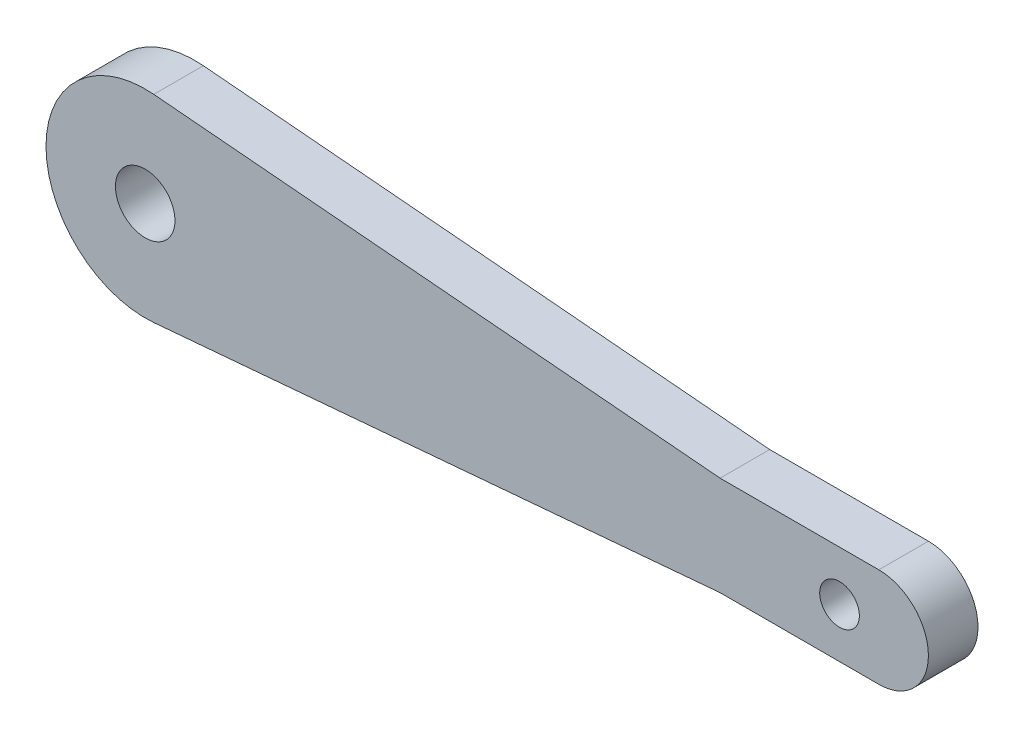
ISO-10303-21;
HEADER;
FILE_DESCRIPTION(('STEP AP214'),'2;1');
FILE_NAME('part.step','',(''),(''),'','','');
FILE_SCHEMA(('AUTOMOTIVE_DESIGN { 1 0 10303 214 1 1 1 1 }'));
ENDSEC;
DATA;
#1=APPLICATION_CONTEXT('core data for automotive mechanical design processes');
#2=APPLICATION_PROTOCOL_DEFINITION('international standard','automotive_design',2000,#1);
#3=PRODUCT_CONTEXT('',#1,'mechanical');
#4=PRODUCT('Part','Part','',(#3));
#5=PRODUCT_RELATED_PRODUCT_CATEGORY('part','',(#4));
#6=PRODUCT_DEFINITION_FORMATION('','',#4);
#7=PRODUCT_DEFINITION_CONTEXT('part definition',#1,'design');
#8=PRODUCT_DEFINITION('design','',#6,#7);
#9=PRODUCT_DEFINITION_SHAPE('','',#8);
#10=(LENGTH_UNIT() NAMED_UNIT(*) SI_UNIT(.MILLI.,.METRE.));
#11=(NAMED_UNIT(*) PLANE_ANGLE_UNIT() SI_UNIT($,.RADIAN.));
#12=(NAMED_UNIT(*) SI_UNIT($,.STERADIAN.) SOLID_ANGLE_UNIT());
#13=UNCERTAINTY_MEASURE_WITH_UNIT(LENGTH_MEASURE(1.E-05),#10,'distance_accuracy_value','');
#14=(GEOMETRIC_REPRESENTATION_CONTEXT(3) GLOBAL_UNCERTAINTY_ASSIGNED_CONTEXT((#13)) GLOBAL_UNIT_ASSIGNED_CONTEXT((#10,
#11,#12)) REPRESENTATION_CONTEXT('',''));
#15=CARTESIAN_POINT('',(0.,0.,0.));
#16=DIRECTION('',(0.,0.,1.));
#17=DIRECTION('',(1.,0.,0.));
#18=AXIS2_PLACEMENT_3D('',#15,#16,#17);
#19=CARTESIAN_POINT('',(0.,0.,1.25));
#20=DIRECTION('',(0.,0.,1.));
#21=DIRECTION('',(1.,0.,0.));
#22=AXIS2_PLACEMENT_3D('',#19,#20,#21);
#23=PLANE('',#22);
#24=CARTESIAN_POINT('',(-1.98,0.,1.25));
#25=DIRECTION('',(0.,0.,1.));
#26=DIRECTION('',(1.,0.,0.));
#27=AXIS2_PLACEMENT_3D('',#24,#25,#26);
#28=CIRCLE('',#27,1.);
#29=CARTESIAN_POINT('',(-0.98,0.,1.25));
#30=VERTEX_POINT('',#29);
#31=EDGE_CURVE('E123',#30,#30,#28,.T.);
#32=ORIENTED_EDGE('',*,*,#31,.F.);
#33=EDGE_LOOP('',(#32));
#34=FACE_BOUND('',#33,.T.);
#35=CARTESIAN_POINT('',(0.,0.,1.25));
#36=DIRECTION('',(0.,0.,1.));
#37=DIRECTION('',(1.,0.,0.));
#38=AXIS2_PLACEMENT_3D('',#35,#36,#37);
#39=CIRCLE('',#38,2.5);
#40=CARTESIAN_POINT('',(0.,-2.5,1.25));
#41=VERTEX_POINT('',#40);
#42=CARTESIAN_POINT('',(0.,2.5,1.25));
#43=VERTEX_POINT('',#42);
#44=EDGE_CURVE('E130',#41,#43,#39,.T.);
#45=ORIENTED_EDGE('',*,*,#44,.T.);
#46=DIRECTION('',(-1.,0.,0.));
#47=VECTOR('',#46,1.);
#48=CARTESIAN_POINT('',(0.,2.5,1.25));
#49=LINE('',#48,#47);
#50=CARTESIAN_POINT('',(-8.,2.5,1.25));
#51=VERTEX_POINT('',#50);
#52=EDGE_CURVE('E88',#43,#51,#49,.T.);
#53=ORIENTED_EDGE('',*,*,#52,.T.);
#54=DIRECTION('',(-0.996243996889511,0.0865904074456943,0.));
#55=VECTOR('',#54,1.);
#56=CARTESIAN_POINT('',(-8.,2.5,1.25));
#57=LINE('',#56,#55);
#58=CARTESIAN_POINT('',(-36.5470479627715,4.98121998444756,1.25));
#59=VERTEX_POINT('',#58);
#60=EDGE_CURVE('E101',#51,#59,#57,.T.);
#61=ORIENTED_EDGE('',*,*,#60,.T.);
#62=CARTESIAN_POINT('',(-36.98,0.,1.25));
#63=DIRECTION('',(0.,0.,1.));
#64=DIRECTION('',(1.,0.,0.));
#65=AXIS2_PLACEMENT_3D('',#62,#63,#64);
#66=CIRCLE('',#65,5.);
#67=CARTESIAN_POINT('',(-36.5470479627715,-4.98121998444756,1.25));
#68=VERTEX_POINT('',#67);
#69=EDGE_CURVE('E95',#59,#68,#66,.T.);
#70=ORIENTED_EDGE('',*,*,#69,.T.);
#71=DIRECTION('',(0.996243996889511,0.0865904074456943,0.));
#72=VECTOR('',#71,1.);
#73=CARTESIAN_POINT('',(-8.,-2.5,1.25));
#74=LINE('',#73,#72);
#75=CARTESIAN_POINT('',(-8.,-2.5,1.25));
#76=VERTEX_POINT('',#75);
#77=EDGE_CURVE('E99',#68,#76,#74,.T.);
#78=ORIENTED_EDGE('',*,*,#77,.T.);
#79=DIRECTION('',(1.,0.,0.));
#80=VECTOR('',#79,1.);
#81=CARTESIAN_POINT('',(0.,-2.5,1.25));
#82=LINE('',#81,#80);
#83=EDGE_CURVE('E51',#76,#41,#82,.T.);
#84=ORIENTED_EDGE('',*,*,#83,.T.);
#85=EDGE_LOOP('',(#45,#53,#61,#70,#78,#84));
#86=FACE_BOUND('',#85,.T.);
#87=CARTESIAN_POINT('',(-36.98,0.,1.25));
#88=DIRECTION('',(0.,0.,1.));
#89=DIRECTION('',(1.,0.,0.));
#90=AXIS2_PLACEMENT_3D('',#87,#88,#89);
#91=CIRCLE('',#90,1.5);
#92=CARTESIAN_POINT('',(-35.48,0.,1.25));
#93=VERTEX_POINT('',#92);
#94=EDGE_CURVE('E172',#93,#93,#91,.T.);
#95=ORIENTED_EDGE('',*,*,#94,.F.);
#96=EDGE_LOOP('',(#95));
#97=FACE_BOUND('',#96,.T.);
#98=ADVANCED_FACE('F34',(#34,#86,#97),#23,.T.);
#99=CARTESIAN_POINT('',(0.,0.,-1.25));
#100=DIRECTION('',(0.,0.,1.));
#101=DIRECTION('',(1.,0.,0.));
#102=AXIS2_PLACEMENT_3D('',#99,#100,#101);
#103=PLANE('',#102);
#104=CARTESIAN_POINT('',(0.,0.,-1.25));
#105=DIRECTION('',(0.,0.,1.));
#106=DIRECTION('',(1.,0.,0.));
#107=AXIS2_PLACEMENT_3D('',#104,#105,#106);
#108=CIRCLE('',#107,2.5);
#109=CARTESIAN_POINT('',(0.,-2.5,-1.25));
#110=VERTEX_POINT('',#109);
#111=CARTESIAN_POINT('',(0.,2.5,-1.25));
#112=VERTEX_POINT('',#111);
#113=EDGE_CURVE('E119',#110,#112,#108,.T.);
#114=ORIENTED_EDGE('',*,*,#113,.F.);
#115=DIRECTION('',(1.,0.,0.));
#116=VECTOR('',#115,1.);
#117=CARTESIAN_POINT('',(0.,-2.5,-1.25));
#118=LINE('',#117,#116);
#119=CARTESIAN_POINT('',(-8.,-2.5,-1.25));
#120=VERTEX_POINT('',#119);
#121=EDGE_CURVE('E80',#120,#110,#118,.T.);
#122=ORIENTED_EDGE('',*,*,#121,.F.);
#123=DIRECTION('',(0.996243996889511,0.0865904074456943,0.));
#124=VECTOR('',#123,1.);
#125=CARTESIAN_POINT('',(-8.,-2.5,-1.25));
#126=LINE('',#125,#124);
#127=CARTESIAN_POINT('',(-36.5470479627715,-4.98121998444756,-1.25));
#128=VERTEX_POINT('',#127);
#129=EDGE_CURVE('E74',#128,#120,#126,.T.);
#130=ORIENTED_EDGE('',*,*,#129,.F.);
#131=CARTESIAN_POINT('',(-36.98,0.,-1.25));
#132=DIRECTION('',(0.,0.,1.));
#133=DIRECTION('',(1.,0.,0.));
#134=AXIS2_PLACEMENT_3D('',#131,#132,#133);
#135=CIRCLE('',#134,5.);
#136=CARTESIAN_POINT('',(-36.5470479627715,4.98121998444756,-1.25));
#137=VERTEX_POINT('',#136);
#138=EDGE_CURVE('E109',#137,#128,#135,.T.);
#139=ORIENTED_EDGE('',*,*,#138,.F.);
#140=DIRECTION('',(-0.996243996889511,0.0865904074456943,0.));
#141=VECTOR('',#140,1.);
#142=CARTESIAN_POINT('',(-8.,2.5,-1.25));
#143=LINE('',#142,#141);
#144=CARTESIAN_POINT('',(-8.,2.5,-1.25));
#145=VERTEX_POINT('',#144);
#146=EDGE_CURVE('E125',#145,#137,#143,.T.);
#147=ORIENTED_EDGE('',*,*,#146,.F.);
#148=DIRECTION('',(-1.,0.,0.));
#149=VECTOR('',#148,1.);
#150=CARTESIAN_POINT('',(0.,2.5,-1.25));
#151=LINE('',#150,#149);
#152=EDGE_CURVE('E122',#112,#145,#151,.T.);
#153=ORIENTED_EDGE('',*,*,#152,.F.);
#154=EDGE_LOOP('',(#114,#122,#130,#139,#147,#153));
#155=FACE_BOUND('',#154,.T.);
#156=CARTESIAN_POINT('',(-1.98,0.,-1.25));
#157=DIRECTION('',(0.,0.,1.));
#158=DIRECTION('',(1.,0.,0.));
#159=AXIS2_PLACEMENT_3D('',#156,#157,#158);
#160=CIRCLE('',#159,1.);
#161=CARTESIAN_POINT('',(-0.98,0.,-1.25));
#162=VERTEX_POINT('',#161);
#163=EDGE_CURVE('E178',#162,#162,#160,.T.);
#164=ORIENTED_EDGE('',*,*,#163,.T.);
#165=EDGE_LOOP('',(#164));
#166=FACE_BOUND('',#165,.T.);
#167=CARTESIAN_POINT('',(-36.98,0.,-1.25));
#168=DIRECTION('',(0.,0.,1.));
#169=DIRECTION('',(1.,0.,0.));
#170=AXIS2_PLACEMENT_3D('',#167,#168,#169);
#171=CIRCLE('',#170,1.5);
#172=CARTESIAN_POINT('',(-35.48,0.,-1.25));
#173=VERTEX_POINT('',#172);
#174=EDGE_CURVE('E175',#173,#173,#171,.T.);
#175=ORIENTED_EDGE('',*,*,#174,.T.);
#176=EDGE_LOOP('',(#175));
#177=FACE_BOUND('',#176,.T.);
#178=ADVANCED_FACE('F139',(#155,#166,#177),#103,.F.);
#179=CARTESIAN_POINT('',(0.,0.,1.25));
#180=DIRECTION('',(0.,0.,-1.));
#181=DIRECTION('',(-1.,0.,0.));
#182=AXIS2_PLACEMENT_3D('',#179,#180,#181);
#183=CYLINDRICAL_SURFACE('',#182,2.5);
#184=ORIENTED_EDGE('',*,*,#113,.T.);
#185=DIRECTION('',(0.,0.,-1.));
#186=VECTOR('',#185,1.);
#187=CARTESIAN_POINT('',(0.,2.5,1.25));
#188=LINE('',#187,#186);
#189=EDGE_CURVE('E11',#43,#112,#188,.T.);
#190=ORIENTED_EDGE('',*,*,#189,.F.);
#191=ORIENTED_EDGE('',*,*,#44,.F.);
#192=DIRECTION('',(0.,0.,-1.));
#193=VECTOR('',#192,1.);
#194=CARTESIAN_POINT('',(0.,-2.5,1.25));
#195=LINE('',#194,#193);
#196=EDGE_CURVE('E115',#41,#110,#195,.T.);
#197=ORIENTED_EDGE('',*,*,#196,.T.);
#198=EDGE_LOOP('',(#184,#190,#191,#197));
#199=FACE_BOUND('',#198,.T.);
#200=ADVANCED_FACE('F36',(#199),#183,.T.);
#201=CARTESIAN_POINT('',(0.,2.5,1.25));
#202=DIRECTION('',(0.,-1.,0.));
#203=DIRECTION('',(0.,0.,-1.));
#204=AXIS2_PLACEMENT_3D('',#201,#202,#203);
#205=PLANE('',#204);
#206=ORIENTED_EDGE('',*,*,#152,.T.);
#207=DIRECTION('',(0.,0.,-1.));
#208=VECTOR('',#207,1.);
#209=CARTESIAN_POINT('',(-8.,2.5,1.25));
#210=LINE('',#209,#208);
#211=EDGE_CURVE('E43',#51,#145,#210,.T.);
#212=ORIENTED_EDGE('',*,*,#211,.F.);
#213=ORIENTED_EDGE('',*,*,#52,.F.);
#214=ORIENTED_EDGE('',*,*,#189,.T.);
#215=EDGE_LOOP('',(#206,#212,#213,#214));
#216=FACE_BOUND('',#215,.T.);
#217=ADVANCED_FACE('F219',(#216),#205,.F.);
#218=CARTESIAN_POINT('',(-8.,2.5,1.25));
#219=DIRECTION('',(-0.0865904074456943,-0.996243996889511,0.));
#220=DIRECTION('',(0.996243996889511,-0.0865904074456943,0.));
#221=AXIS2_PLACEMENT_3D('',#218,#219,#220);
#222=PLANE('',#221);
#223=ORIENTED_EDGE('',*,*,#146,.T.);
#224=DIRECTION('',(0.,0.,-1.));
#225=VECTOR('',#224,1.);
#226=CARTESIAN_POINT('',(-36.5470479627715,4.98121998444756,1.25));
#227=LINE('',#226,#225);
#228=EDGE_CURVE('E110',#59,#137,#227,.T.);
#229=ORIENTED_EDGE('',*,*,#228,.F.);
#230=ORIENTED_EDGE('',*,*,#60,.F.);
#231=ORIENTED_EDGE('',*,*,#211,.T.);
#232=EDGE_LOOP('',(#223,#229,#230,#231));
#233=FACE_BOUND('',#232,.T.);
#234=ADVANCED_FACE('F136',(#233),#222,.F.);
#235=CARTESIAN_POINT('',(-36.98,0.,1.25));
#236=DIRECTION('',(0.,0.,-1.));
#237=DIRECTION('',(-1.,0.,0.));
#238=AXIS2_PLACEMENT_3D('',#235,#236,#237);
#239=CYLINDRICAL_SURFACE('',#238,5.);
#240=ORIENTED_EDGE('',*,*,#138,.T.);
#241=DIRECTION('',(0.,0.,-1.));
#242=VECTOR('',#241,1.);
#243=CARTESIAN_POINT('',(-36.5470479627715,-4.98121998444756,1.25));
#244=LINE('',#243,#242);
#245=EDGE_CURVE('E106',#68,#128,#244,.T.);
#246=ORIENTED_EDGE('',*,*,#245,.F.);
#247=ORIENTED_EDGE('',*,*,#69,.F.);
#248=ORIENTED_EDGE('',*,*,#228,.T.);
#249=EDGE_LOOP('',(#240,#246,#247,#248));
#250=FACE_BOUND('',#249,.T.);
#251=ADVANCED_FACE('F107',(#250),#239,.T.);
#252=CARTESIAN_POINT('',(-8.,-2.5,1.25));
#253=DIRECTION('',(-0.0865904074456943,0.996243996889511,0.));
#254=DIRECTION('',(-0.996243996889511,-0.0865904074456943,0.));
#255=AXIS2_PLACEMENT_3D('',#252,#253,#254);
#256=PLANE('',#255);
#257=ORIENTED_EDGE('',*,*,#129,.T.);
#258=DIRECTION('',(0.,0.,-1.));
#259=VECTOR('',#258,1.);
#260=CARTESIAN_POINT('',(-8.,-2.5,1.25));
#261=LINE('',#260,#259);
#262=EDGE_CURVE('E111',#76,#120,#261,.T.);
#263=ORIENTED_EDGE('',*,*,#262,.F.);
#264=ORIENTED_EDGE('',*,*,#77,.F.);
#265=ORIENTED_EDGE('',*,*,#245,.T.);
#266=EDGE_LOOP('',(#257,#263,#264,#265));
#267=FACE_BOUND('',#266,.T.);
#268=ADVANCED_FACE('F113',(#267),#256,.F.);
#269=CARTESIAN_POINT('',(0.,-2.5,1.25));
#270=DIRECTION('',(0.,1.,0.));
#271=DIRECTION('',(0.,0.,1.));
#272=AXIS2_PLACEMENT_3D('',#269,#270,#271);
#273=PLANE('',#272);
#274=ORIENTED_EDGE('',*,*,#121,.T.);
#275=ORIENTED_EDGE('',*,*,#196,.F.);
#276=ORIENTED_EDGE('',*,*,#83,.F.);
#277=ORIENTED_EDGE('',*,*,#262,.T.);
#278=EDGE_LOOP('',(#274,#275,#276,#277));
#279=FACE_BOUND('',#278,.T.);
#280=ADVANCED_FACE('F144',(#279),#273,.F.);
#281=CARTESIAN_POINT('',(-1.98,0.,1.25));
#282=DIRECTION('',(0.,0.,-1.));
#283=DIRECTION('',(-1.,0.,0.));
#284=AXIS2_PLACEMENT_3D('',#281,#282,#283);
#285=CYLINDRICAL_SURFACE('',#284,1.);
#286=ORIENTED_EDGE('',*,*,#31,.T.);
#287=EDGE_LOOP('',(#286));
#288=FACE_BOUND('',#287,.T.);
#289=ORIENTED_EDGE('',*,*,#163,.F.);
#290=EDGE_LOOP('',(#289));
#291=FACE_BOUND('',#290,.T.);
#292=ADVANCED_FACE('F146',(#288,#291),#285,.F.);
#293=CARTESIAN_POINT('',(-36.98,0.,1.25));
#294=DIRECTION('',(0.,0.,-1.));
#295=DIRECTION('',(-1.,0.,0.));
#296=AXIS2_PLACEMENT_3D('',#293,#294,#295);
#297=CYLINDRICAL_SURFACE('',#296,1.5);
#298=ORIENTED_EDGE('',*,*,#94,.T.);
#299=EDGE_LOOP('',(#298));
#300=FACE_BOUND('',#299,.T.);
#301=ORIENTED_EDGE('',*,*,#174,.F.);
#302=EDGE_LOOP('',(#301));
#303=FACE_BOUND('',#302,.T.);
#304=ADVANCED_FACE('F152',(#300,#303),#297,.F.);
#305=CLOSED_SHELL('',(#98,#178,#200,#217,#234,#251,#268,#280,#292,#304));
#306=MANIFOLD_SOLID_BREP('B2',#305);
#307=ADVANCED_BREP_SHAPE_REPRESENTATION('',(#18,#306),#14);
#308=SHAPE_DEFINITION_REPRESENTATION(#9,#307);
ENDSEC;
END-ISO-10303-21;
